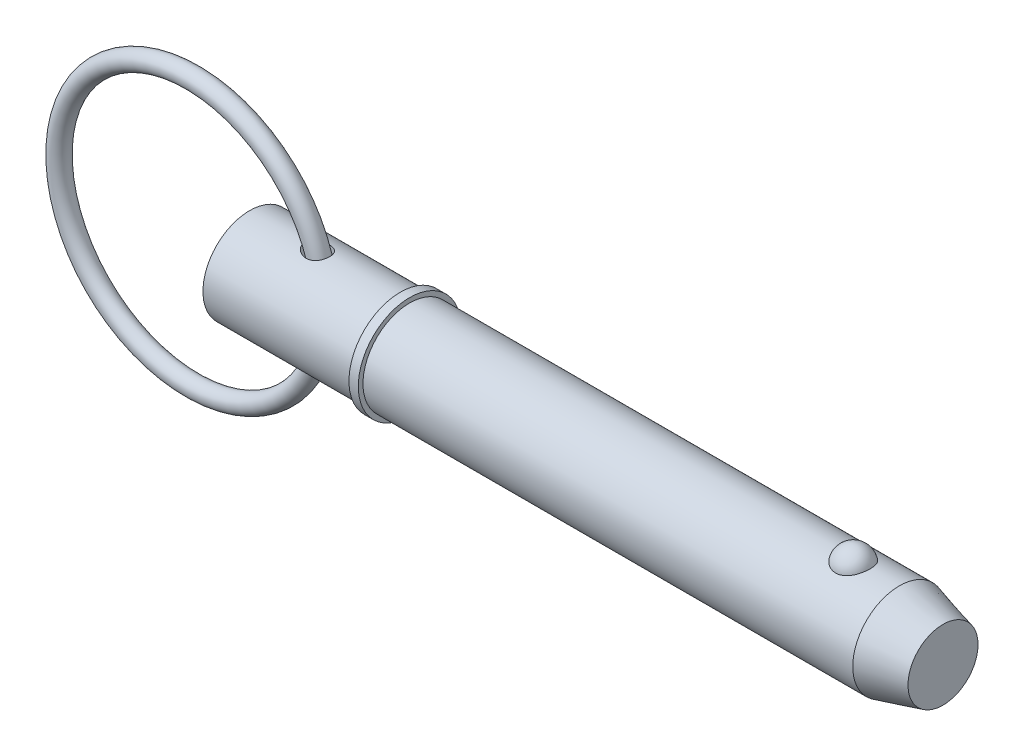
ISO-10303-21;
HEADER;
FILE_DESCRIPTION(('STEP AP214'),'2;1');
FILE_NAME('part.step','',(''),(''),'','','');
FILE_SCHEMA(('AUTOMOTIVE_DESIGN { 1 0 10303 214 1 1 1 1 }'));
ENDSEC;
DATA;
#1=APPLICATION_CONTEXT('core data for automotive mechanical design processes');
#2=APPLICATION_PROTOCOL_DEFINITION('international standard','automotive_design',2000,#1);
#3=PRODUCT_CONTEXT('',#1,'mechanical');
#4=PRODUCT('Part','Part','',(#3));
#5=PRODUCT_RELATED_PRODUCT_CATEGORY('part','',(#4));
#6=PRODUCT_DEFINITION_FORMATION('','',#4);
#7=PRODUCT_DEFINITION_CONTEXT('part definition',#1,'design');
#8=PRODUCT_DEFINITION('design','',#6,#7);
#9=PRODUCT_DEFINITION_SHAPE('','',#8);
#10=(LENGTH_UNIT() NAMED_UNIT(*) SI_UNIT(.MILLI.,.METRE.));
#11=(NAMED_UNIT(*) PLANE_ANGLE_UNIT() SI_UNIT($,.RADIAN.));
#12=(NAMED_UNIT(*) SI_UNIT($,.STERADIAN.) SOLID_ANGLE_UNIT());
#13=UNCERTAINTY_MEASURE_WITH_UNIT(LENGTH_MEASURE(1.E-05),#10,'distance_accuracy_value','');
#14=(GEOMETRIC_REPRESENTATION_CONTEXT(3) GLOBAL_UNCERTAINTY_ASSIGNED_CONTEXT((#13)) GLOBAL_UNIT_ASSIGNED_CONTEXT((#10,
#11,#12)) REPRESENTATION_CONTEXT('',''));
#15=CARTESIAN_POINT('',(0.,0.,0.));
#16=DIRECTION('',(0.,0.,1.));
#17=DIRECTION('',(1.,0.,0.));
#18=AXIS2_PLACEMENT_3D('',#15,#16,#17);
#19=CARTESIAN_POINT('',(-13.640845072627,0.,0.));
#20=DIRECTION('',(0.,0.,1.));
#21=DIRECTION('',(1.,0.,0.));
#22=AXIS2_PLACEMENT_3D('',#19,#20,#21);
#23=TOROIDAL_SURFACE('',#22,31.75,2.223);
#24=CARTESIAN_POINT('',(20.332154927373,0.,0.));
#25=VERTEX_POINT('',#24);
#26=VERTEX_LOOP('',#25);
#27=FACE_BOUND('',#26,.T.);
#28=ADVANCED_FACE('P0_F12',(#27),#23,.T.);
#29=CLOSED_SHELL('',(#28));
#30=MANIFOLD_SOLID_BREP('P0_B1',#29);
#31=CARTESIAN_POINT('',(0.,0.,0.));
#32=DIRECTION('',(1.,0.,0.));
#33=DIRECTION('',(0.,0.,-1.));
#34=AXIS2_PLACEMENT_3D('',#31,#32,#33);
#35=CYLINDRICAL_SURFACE('',#34,11.115);
#36=CARTESIAN_POINT('',(13.5245830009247,11.0328953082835,-1.34849772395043));
#37=CARTESIAN_POINT('',(13.6190616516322,11.0150940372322,-1.49413162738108));
#38=CARTESIAN_POINT('',(13.7272589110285,10.9954577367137,-1.63076546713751));
#39=CARTESIAN_POINT('',(13.9654537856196,10.9550099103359,-1.8834727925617));
#40=CARTESIAN_POINT('',(14.0954990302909,10.9341958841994,-1.99950019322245));
#41=CARTESIAN_POINT('',(14.3718600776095,10.893854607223,-2.20871939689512));
#42=CARTESIAN_POINT('',(14.5180879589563,10.8743212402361,-2.30202655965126));
#43=CARTESIAN_POINT('',(14.8233821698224,10.8385071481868,-2.46515115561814));
#44=CARTESIAN_POINT('',(14.9824448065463,10.8222254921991,-2.53497531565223));
#45=CARTESIAN_POINT('',(15.3233581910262,10.7936101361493,-2.65430007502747));
#46=CARTESIAN_POINT('',(15.5060064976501,10.7817126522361,-2.7016502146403));
#47=CARTESIAN_POINT('',(15.8771124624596,10.7657570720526,-2.76455948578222));
#48=CARTESIAN_POINT('',(16.0655695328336,10.7616981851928,-2.78012182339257));
#49=CARTESIAN_POINT('',(16.4345152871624,10.7624400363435,-2.77724928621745));
#50=CARTESIAN_POINT('',(16.6150121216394,10.7668823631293,-2.76018977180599));
#51=CARTESIAN_POINT('',(16.9695132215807,10.7837407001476,-2.69357457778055));
#52=CARTESIAN_POINT('',(17.1435222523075,10.7961507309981,-2.64404326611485));
#53=CARTESIAN_POINT('',(17.4621418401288,10.8258984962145,-2.51928348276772));
#54=CARTESIAN_POINT('',(17.6079677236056,10.8426430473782,-2.44700611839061));
#55=CARTESIAN_POINT('',(17.884162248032,10.8794194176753,-2.27791740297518));
#56=CARTESIAN_POINT('',(18.0145349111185,10.8994503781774,-2.18111245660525));
#57=CARTESIAN_POINT('',(18.2494965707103,10.9392822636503,-1.9713196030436));
#58=CARTESIAN_POINT('',(18.3550661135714,10.9590421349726,-1.85941863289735));
#59=CARTESIAN_POINT('',(18.5458147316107,10.9970986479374,-1.61919918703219));
#60=CARTESIAN_POINT('',(18.6309947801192,11.0153953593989,-1.49088149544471));
#61=CARTESIAN_POINT('',(18.7786686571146,11.0484675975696,-1.2218388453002));
#62=CARTESIAN_POINT('',(18.8412214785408,11.063252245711,-1.08114735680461));
#63=CARTESIAN_POINT('',(18.9425265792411,11.0877718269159,-0.791025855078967));
#64=CARTESIAN_POINT('',(18.9812780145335,11.0975065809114,-0.641595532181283));
#65=CARTESIAN_POINT('',(19.0343305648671,11.1109435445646,-0.336997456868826));
#66=CARTESIAN_POINT('',(19.0484404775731,11.1145985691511,-0.181794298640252));
#67=CARTESIAN_POINT('',(19.0513147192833,11.1153384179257,0.128864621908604));
#68=CARTESIAN_POINT('',(19.0400783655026,11.112423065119,0.284320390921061));
#69=CARTESIAN_POINT('',(18.9924362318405,11.1003163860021,0.591525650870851));
#70=CARTESIAN_POINT('',(18.9559600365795,11.0911075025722,0.743263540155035));
#71=CARTESIAN_POINT('',(18.858576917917,11.0673920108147,1.0382524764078));
#72=CARTESIAN_POINT('',(18.7976699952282,11.0528854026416,1.18150352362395));
#73=CARTESIAN_POINT('',(18.6529960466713,11.020201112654,1.45511394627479));
#74=CARTESIAN_POINT('',(18.5692772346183,11.0020311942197,1.58549973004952));
#75=CARTESIAN_POINT('',(18.3810003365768,10.9640237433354,1.82995492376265));
#76=CARTESIAN_POINT('',(18.2764441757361,10.9441863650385,1.94402583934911));
#77=CARTESIAN_POINT('',(18.0501398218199,10.9052267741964,2.15183128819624));
#78=CARTESIAN_POINT('',(17.9285270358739,10.8861003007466,2.24571250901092));
#79=CARTESIAN_POINT('',(17.6709592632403,10.8505244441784,2.41175942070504));
#80=CARTESIAN_POINT('',(17.5350055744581,10.8340748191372,2.48392707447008));
#81=CARTESIAN_POINT('',(17.2528390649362,10.8056099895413,2.60497667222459));
#82=CARTESIAN_POINT('',(17.1066353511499,10.7935909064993,2.65387899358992));
#83=CARTESIAN_POINT('',(16.8080326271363,10.7750969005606,2.72799859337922));
#84=CARTESIAN_POINT('',(16.6556326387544,10.7686228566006,2.75321211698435));
#85=CARTESIAN_POINT('',(16.3428877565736,10.761517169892,2.78086153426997));
#86=CARTESIAN_POINT('',(16.1824599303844,10.7611149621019,2.78240297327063));
#87=CARTESIAN_POINT('',(15.863296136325,10.766478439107,2.76156874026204));
#88=CARTESIAN_POINT('',(15.7045607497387,10.7722461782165,2.73918510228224));
#89=CARTESIAN_POINT('',(15.3787211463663,10.7898500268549,2.66904167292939));
#90=CARTESIAN_POINT('',(15.2120794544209,10.8021675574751,2.61925575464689));
#91=CARTESIAN_POINT('',(14.8886284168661,10.8315482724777,2.49496357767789));
#92=CARTESIAN_POINT('',(14.731827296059,10.8486153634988,2.42043695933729));
#93=CARTESIAN_POINT('',(14.4198762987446,10.8870804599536,2.24137362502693));
#94=CARTESIAN_POINT('',(14.2658484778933,10.9087148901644,2.13492229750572));
#95=CARTESIAN_POINT('',(13.9788214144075,10.9526299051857,1.89676517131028));
#96=CARTESIAN_POINT('',(13.8458041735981,10.9749099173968,1.76508120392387));
#97=CARTESIAN_POINT('',(13.6310853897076,11.012885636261,1.50762337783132));
#98=CARTESIAN_POINT('',(13.5444453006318,11.0290026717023,1.38602082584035));
#99=CARTESIAN_POINT('',(13.392158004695,11.0581740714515,1.12983363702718));
#100=CARTESIAN_POINT('',(13.3264946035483,11.0712307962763,0.995259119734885));
#101=CARTESIAN_POINT('',(13.2464179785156,11.0874250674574,0.785640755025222));
#102=CARTESIAN_POINT('',(13.2227369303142,11.0922707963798,0.714166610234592));
#103=CARTESIAN_POINT('',(13.1820656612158,11.1006486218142,0.569277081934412));
#104=CARTESIAN_POINT('',(13.1650721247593,11.1041813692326,0.495862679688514));
#105=CARTESIAN_POINT('',(13.1381118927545,11.1098070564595,0.347711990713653));
#106=CARTESIAN_POINT('',(13.1281436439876,11.1119003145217,0.272975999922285));
#107=CARTESIAN_POINT('',(13.1154243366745,11.1145746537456,0.122890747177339));
#108=CARTESIAN_POINT('',(13.1126723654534,11.1151559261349,0.0475415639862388));
#109=CARTESIAN_POINT('',(13.115160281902,11.1146296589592,-0.160384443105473));
#110=CARTESIAN_POINT('',(13.128061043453,11.111903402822,-0.292944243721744));
#111=CARTESIAN_POINT('',(13.175691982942,11.1019662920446,-0.553751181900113));
#112=CARTESIAN_POINT('',(13.2104121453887,11.094757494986,-0.682000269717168));
#113=CARTESIAN_POINT('',(13.2891255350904,11.0787645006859,-0.901873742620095));
#114=CARTESIAN_POINT('',(13.3290466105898,11.0707438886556,-0.995044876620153));
#115=CARTESIAN_POINT('',(13.4192915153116,11.0529876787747,-1.17599209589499));
#116=CARTESIAN_POINT('',(13.4696154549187,11.0432520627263,-1.26376812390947));
#117=CARTESIAN_POINT('',(13.5245830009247,11.0328953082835,-1.34849772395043));
#118=B_SPLINE_CURVE_WITH_KNOTS('',3,(#36,#37,#38,#39,#40,#41,#42,#43,#44,#45,#46,#47,#48,#49,
#50,#51,#52,#53,#54,#55,#56,#57,#58,#59,#60,#61,#62,#63,#64,#65,#66,#67,#68,#69,#70,#71,#72,#73,
#74,#75,#76,#77,#78,#79,#80,#81,#82,#83,#84,#85,#86,#87,#88,#89,#90,#91,#92,#93,#94,#95,#96,#97,
#98,#99,#100,#101,#102,#103,#104,#105,#106,#107,#108,#109,#110,#111,#112,#113,#114,#115,#116,
#117),.UNSPECIFIED.,.T.,.F.,(4,2,2,2,2,2,2,2,2,2,2,2,2,2,2,2,2,2,2,2,2,2,2,2,2,2,2,2,2,2,2,2,2,
2,2,2,2,2,2,2,4),(0.,0.52309976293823,1.04735506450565,1.56889024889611,2.09027590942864,
2.65465173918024,3.21897064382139,3.76002078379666,4.30066536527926,4.78898318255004,
5.27717362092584,5.74028268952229,6.20336964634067,6.665240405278,7.12712754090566,
7.59258295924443,8.05805091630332,8.52482272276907,8.99159451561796,9.45738731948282,
9.9231371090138,10.3853792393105,10.8475795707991,11.3093743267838,11.7712422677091,
12.2505208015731,12.7299589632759,13.2508366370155,13.7721440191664,14.334890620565,
14.8971525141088,15.3459336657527,15.7943675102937,16.0204422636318,16.2464047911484,
16.4723173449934,16.6982013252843,17.095711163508,17.4930386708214,17.7973741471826,
18.1017128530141),.UNSPECIFIED.);
#119=CARTESIAN_POINT('',(13.5245830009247,11.0328953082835,-1.34849772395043));
#120=VERTEX_POINT('',#119);
#121=EDGE_CURVE('P1_E42',#120,#120,#118,.T.);
#122=ORIENTED_EDGE('',*,*,#121,.T.);
#123=EDGE_LOOP('',(#122));
#124=FACE_BOUND('',#123,.T.);
#125=CARTESIAN_POINT('',(0.,0.,0.));
#126=DIRECTION('',(1.,0.,0.));
#127=DIRECTION('',(0.,0.,-1.));
#128=AXIS2_PLACEMENT_3D('',#125,#126,#127);
#129=CIRCLE('',#128,11.115);
#130=CARTESIAN_POINT('',(0.,0.,-11.115));
#131=VERTEX_POINT('',#130);
#132=EDGE_CURVE('P1_E9',#131,#131,#129,.T.);
#133=ORIENTED_EDGE('',*,*,#132,.T.);
#134=EDGE_LOOP('',(#133));
#135=FACE_BOUND('',#134,.T.);
#136=CARTESIAN_POINT('',(35.877,0.,0.));
#137=DIRECTION('',(1.,0.,0.));
#138=DIRECTION('',(0.,0.,-1.));
#139=AXIS2_PLACEMENT_3D('',#136,#137,#138);
#140=CIRCLE('',#139,11.115);
#141=CARTESIAN_POINT('',(35.877,0.,-11.115));
#142=VERTEX_POINT('',#141);
#143=EDGE_CURVE('P1_E25',#142,#142,#140,.T.);
#144=ORIENTED_EDGE('',*,*,#143,.F.);
#145=EDGE_LOOP('',(#144));
#146=FACE_BOUND('',#145,.T.);
#147=CARTESIAN_POINT('',(13.5245830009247,-11.0328953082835,-1.34849772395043));
#148=CARTESIAN_POINT('',(13.449887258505,-11.0469690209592,-1.233356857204));
#149=CARTESIAN_POINT('',(13.3837464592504,-11.0598986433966,-1.11255897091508));
#150=CARTESIAN_POINT('',(13.271526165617,-11.0822620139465,-0.861680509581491));
#151=CARTESIAN_POINT('',(13.2254273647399,-11.0916991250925,-0.731609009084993));
#152=CARTESIAN_POINT('',(13.1557497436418,-11.1060943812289,-0.464578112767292));
#153=CARTESIAN_POINT('',(13.1322820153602,-11.111030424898,-0.327588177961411));
#154=CARTESIAN_POINT('',(13.1098958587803,-11.1157368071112,-0.0515139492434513));
#155=CARTESIAN_POINT('',(13.1109730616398,-11.1155080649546,0.0875699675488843));
#156=CARTESIAN_POINT('',(13.1367722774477,-11.110088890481,0.354927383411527));
#157=CARTESIAN_POINT('',(13.160070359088,-11.1051972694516,0.483348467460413));
#158=CARTESIAN_POINT('',(13.2268311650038,-11.091413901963,0.734581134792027));
#159=CARTESIAN_POINT('',(13.2702981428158,-11.0825213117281,0.857391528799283));
#160=CARTESIAN_POINT('',(13.3769008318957,-11.0612491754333,1.09871322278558));
#161=CARTESIAN_POINT('',(13.4406446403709,-11.048763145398,1.21694419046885));
#162=CARTESIAN_POINT('',(13.5844860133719,-11.0215642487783,1.44267020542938));
#163=CARTESIAN_POINT('',(13.6645903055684,-11.0068504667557,1.55016080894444));
#164=CARTESIAN_POINT('',(13.8511803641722,-10.9741237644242,1.76795565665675));
#165=CARTESIAN_POINT('',(13.959808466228,-10.9559422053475,1.87639683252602));
#166=CARTESIAN_POINT('',(14.1916437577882,-10.9197998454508,2.07642617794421));
#167=CARTESIAN_POINT('',(14.3148607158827,-10.901839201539,2.16800294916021));
#168=CARTESIAN_POINT('',(14.5931107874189,-10.8649902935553,2.34622033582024));
#169=CARTESIAN_POINT('',(14.7501095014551,-10.8463937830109,2.42986679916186));
#170=CARTESIAN_POINT('',(15.0757118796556,-10.8136392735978,2.57171975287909));
#171=CARTESIAN_POINT('',(15.2443214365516,-10.7994835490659,2.62991321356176));
#172=CARTESIAN_POINT('',(15.599068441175,-10.7767894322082,2.72147498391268));
#173=CARTESIAN_POINT('',(15.7856559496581,-10.768622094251,2.75321798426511));
#174=CARTESIAN_POINT('',(16.1617095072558,-10.7608206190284,2.78356776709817));
#175=CARTESIAN_POINT('',(16.3511739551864,-10.7611818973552,2.78219235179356));
#176=CARTESIAN_POINT('',(16.7138126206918,-10.7705428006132,2.7457129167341));
#177=CARTESIAN_POINT('',(16.8872269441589,-10.7789612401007,2.71287798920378));
#178=CARTESIAN_POINT('',(17.2247245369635,-10.8028011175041,2.61632772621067));
#179=CARTESIAN_POINT('',(17.3888134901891,-10.8182182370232,2.55263143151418));
#180=CARTESIAN_POINT('',(17.6871641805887,-10.8524191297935,2.40281428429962));
#181=CARTESIAN_POINT('',(17.8227812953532,-10.8707652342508,2.31928155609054));
#182=CARTESIAN_POINT('',(18.0770765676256,-10.9094513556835,2.12988301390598));
#183=CARTESIAN_POINT('',(18.1957578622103,-10.9297910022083,2.0240213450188));
#184=CARTESIAN_POINT('',(18.4088055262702,-10.9693230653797,1.79719870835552));
#185=CARTESIAN_POINT('',(18.5038890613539,-10.9885305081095,1.67691225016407));
#186=CARTESIAN_POINT('',(18.6726701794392,-11.0244347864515,1.42183894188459));
#187=CARTESIAN_POINT('',(18.7463681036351,-11.0411316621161,1.28705232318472));
#188=CARTESIAN_POINT('',(18.8708297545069,-11.0702507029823,1.00634471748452));
#189=CARTESIAN_POINT('',(18.9215212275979,-11.0826593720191,0.860390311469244));
#190=CARTESIAN_POINT('',(18.9984973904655,-11.1017993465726,0.561823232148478));
#191=CARTESIAN_POINT('',(19.0247811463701,-11.1085304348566,0.409210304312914));
#192=CARTESIAN_POINT('',(19.0524622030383,-11.1156244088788,0.100537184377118));
#193=CARTESIAN_POINT('',(19.0536873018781,-11.1159432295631,-0.0555394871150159));
#194=CARTESIAN_POINT('',(19.0307837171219,-11.110065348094,-0.365700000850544));
#195=CARTESIAN_POINT('',(19.0066544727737,-11.1038685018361,-0.519783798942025));
#196=CARTESIAN_POINT('',(18.9335163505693,-11.0856111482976,-0.821817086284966));
#197=CARTESIAN_POINT('',(18.88447016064,-11.0735418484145,-0.969757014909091));
#198=CARTESIAN_POINT('',(18.7625929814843,-11.0448501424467,-1.25502066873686));
#199=CARTESIAN_POINT('',(18.6897623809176,-11.0282278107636,-1.39234456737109));
#200=CARTESIAN_POINT('',(18.522359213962,-10.9923333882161,-1.65195905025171));
#201=CARTESIAN_POINT('',(18.427863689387,-10.9730707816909,-1.77430060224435));
#202=CARTESIAN_POINT('',(18.2194216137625,-10.9340072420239,-2.00099176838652));
#203=CARTESIAN_POINT('',(18.1054772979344,-10.9142063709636,-2.10534344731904));
#204=CARTESIAN_POINT('',(17.8622613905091,-10.8764452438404,-2.2924289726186));
#205=CARTESIAN_POINT('',(17.7331196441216,-10.8584715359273,-2.3753290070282));
#206=CARTESIAN_POINT('',(17.4625069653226,-10.8261386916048,-2.51860389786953));
#207=CARTESIAN_POINT('',(17.3210365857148,-10.8117793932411,-2.57897976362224));
#208=CARTESIAN_POINT('',(17.0290309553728,-10.7880576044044,-2.67648805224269));
#209=CARTESIAN_POINT('',(16.8784484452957,-10.7787241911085,-2.71348542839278));
#210=CARTESIAN_POINT('',(16.573148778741,-10.7659618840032,-2.7636855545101));
#211=CARTESIAN_POINT('',(16.4184306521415,-10.7625343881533,-2.77688267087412));
#212=CARTESIAN_POINT('',(16.1008073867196,-10.761643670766,-2.78033419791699));
#213=CARTESIAN_POINT('',(15.9378898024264,-10.7644957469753,-2.76937572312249));
#214=CARTESIAN_POINT('',(15.6157286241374,-10.7762062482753,-2.72344300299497));
#215=CARTESIAN_POINT('',(15.4564861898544,-10.7850665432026,-2.68846128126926));
#216=CARTESIAN_POINT('',(15.1305734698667,-10.808737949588,-2.59174021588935));
#217=CARTESIAN_POINT('',(14.9645834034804,-10.8240246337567,-2.52782071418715));
#218=CARTESIAN_POINT('',(14.6448218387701,-10.8585969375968,-2.37491543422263));
#219=CARTESIAN_POINT('',(14.4910653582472,-10.8778873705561,-2.28589943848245));
#220=CARTESIAN_POINT('',(14.1837929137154,-10.920550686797,-2.07312951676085));
#221=CARTESIAN_POINT('',(14.0321999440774,-10.9441390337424,-1.94661563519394));
#222=CARTESIAN_POINT('',(13.756115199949,-10.9902311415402,-1.66673537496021));
#223=CARTESIAN_POINT('',(13.6315733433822,-11.0127368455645,-1.51341958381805));
#224=CARTESIAN_POINT('',(13.5245830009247,-11.0328953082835,-1.34849772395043));
#225=B_SPLINE_CURVE_WITH_KNOTS('',3,(#147,#148,#149,#150,#151,#152,#153,#154,#155,#156,#157,
#158,#159,#160,#161,#162,#163,#164,#165,#166,#167,#168,#169,#170,#171,#172,#173,#174,#175,#176,
#177,#178,#179,#180,#181,#182,#183,#184,#185,#186,#187,#188,#189,#190,#191,#192,#193,#194,#195,
#196,#197,#198,#199,#200,#201,#202,#203,#204,#205,#206,#207,#208,#209,#210,#211,#212,#213,#214,
#215,#216,#217,#218,#219,#220,#221,#222,#223,#224),.UNSPECIFIED.,.T.,.F.,(4,2,2,2,2,2,2,2,2,2,2,
2,2,2,2,2,2,2,2,2,2,2,2,2,2,2,2,2,2,2,2,2,2,2,2,2,2,2,4),(0.,0.4133945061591,0.8263899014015,
1.24140245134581,1.65634113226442,2.04635967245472,2.43646050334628,2.83958259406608,
3.24287078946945,3.70479277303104,4.16702582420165,4.70130512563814,5.23585761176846,
5.80123945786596,6.36631739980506,6.89348344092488,7.42032464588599,7.8989135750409,
8.37741373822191,8.83881993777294,9.30021877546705,9.76305681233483,10.2259125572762,
10.6919479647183,11.1579936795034,11.6247393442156,12.0914773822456,12.55658073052,
13.0216306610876,13.4829619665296,13.9442725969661,14.408224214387,14.8722856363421,
15.3601762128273,15.8482186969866,16.3815107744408,16.9154477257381,17.5086806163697,
18.1008056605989),.UNSPECIFIED.);
#226=CARTESIAN_POINT('',(13.5245830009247,-11.0328953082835,-1.34849772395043));
#227=VERTEX_POINT('',#226);
#228=EDGE_CURVE('P1_E17',#227,#227,#225,.T.);
#229=ORIENTED_EDGE('',*,*,#228,.T.);
#230=EDGE_LOOP('',(#229));
#231=FACE_BOUND('',#230,.T.);
#232=ADVANCED_FACE('P1_F13',(#124,#135,#146,#231),#35,.T.);
#233=CARTESIAN_POINT('',(0.,0.,0.));
#234=DIRECTION('',(1.,0.,0.));
#235=DIRECTION('',(0.,0.,-1.));
#236=AXIS2_PLACEMENT_3D('',#233,#234,#235);
#237=CYLINDRICAL_SURFACE('',#236,11.115);
#238=CARTESIAN_POINT('',(154.729563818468,0.,0.));
#239=DIRECTION('',(1.,0.,0.));
#240=DIRECTION('',(0.,0.,-1.));
#241=AXIS2_PLACEMENT_3D('',#238,#239,#240);
#242=CIRCLE('',#241,11.115);
#243=CARTESIAN_POINT('',(154.729563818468,0.,-11.115));
#244=VERTEX_POINT('',#243);
#245=EDGE_CURVE('P1_E99',#244,#244,#242,.T.);
#246=ORIENTED_EDGE('',*,*,#245,.F.);
#247=EDGE_LOOP('',(#246));
#248=FACE_BOUND('',#247,.T.);
#249=CARTESIAN_POINT('',(38.1,0.,0.));
#250=DIRECTION('',(1.,0.,0.));
#251=DIRECTION('',(0.,0.,-1.));
#252=AXIS2_PLACEMENT_3D('',#249,#250,#251);
#253=CIRCLE('',#252,11.115);
#254=CARTESIAN_POINT('',(38.1,0.,-11.115));
#255=VERTEX_POINT('',#254);
#256=EDGE_CURVE('P1_E96',#255,#255,#253,.T.);
#257=ORIENTED_EDGE('',*,*,#256,.T.);
#258=EDGE_LOOP('',(#257));
#259=FACE_BOUND('',#258,.T.);
#260=CARTESIAN_POINT('',(143.731068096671,10.3028087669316,4.17077409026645));
#261=CARTESIAN_POINT('',(143.514775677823,10.3028003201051,4.17078240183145));
#262=CARTESIAN_POINT('',(143.298548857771,10.3098895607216,4.15340593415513));
#263=CARTESIAN_POINT('',(142.872540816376,10.3373834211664,4.08449540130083));
#264=CARTESIAN_POINT('',(142.662757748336,10.3577841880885,4.0329712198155));
#265=CARTESIAN_POINT('',(142.255782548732,10.4095237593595,3.89746513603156));
#266=CARTESIAN_POINT('',(142.058572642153,10.4408466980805,3.81353029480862));
#267=CARTESIAN_POINT('',(141.681338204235,10.5110236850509,3.61560339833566));
#268=CARTESIAN_POINT('',(141.501317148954,10.5498792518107,3.50160528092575));
#269=CARTESIAN_POINT('',(141.157684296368,10.6322884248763,3.24292464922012));
#270=CARTESIAN_POINT('',(140.994686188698,10.6759443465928,3.09746040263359));
#271=CARTESIAN_POINT('',(140.694591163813,10.7625291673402,2.7817192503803));
#272=CARTESIAN_POINT('',(140.557499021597,10.8054579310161,2.61143778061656));
#273=CARTESIAN_POINT('',(140.306408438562,10.8881935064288,2.24226695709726));
#274=CARTESIAN_POINT('',(140.193710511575,10.9277761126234,2.04244123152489));
#275=CARTESIAN_POINT('',(140.001777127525,10.997484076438,1.62578254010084));
#276=CARTESIAN_POINT('',(139.922544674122,11.0276085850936,1.40894804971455));
#277=CARTESIAN_POINT('',(139.798303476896,11.0756732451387,0.961250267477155));
#278=CARTESIAN_POINT('',(139.753760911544,11.0934470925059,0.730239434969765));
#279=CARTESIAN_POINT('',(139.701569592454,11.1143331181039,0.263439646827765));
#280=CARTESIAN_POINT('',(139.693920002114,11.1174456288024,0.0276507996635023));
#281=CARTESIAN_POINT('',(139.71561056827,11.1087161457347,-0.440729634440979));
#282=CARTESIAN_POINT('',(139.744762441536,11.0969502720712,-0.673331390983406));
#283=CARTESIAN_POINT('',(139.839143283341,11.0597872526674,-1.12996621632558));
#284=CARTESIAN_POINT('',(139.904372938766,11.0343898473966,-1.35399912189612));
#285=CARTESIAN_POINT('',(140.06969844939,10.972515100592,-1.78750286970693));
#286=CARTESIAN_POINT('',(140.16983863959,10.9360236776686,-1.9969547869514));
#287=CARTESIAN_POINT('',(140.402940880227,10.8557595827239,-2.3952066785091));
#288=CARTESIAN_POINT('',(140.535905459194,10.8119863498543,-2.5840050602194));
#289=CARTESIAN_POINT('',(140.832407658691,10.7216733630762,-2.93635726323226));
#290=CARTESIAN_POINT('',(140.996056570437,10.675123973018,-3.09981510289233));
#291=CARTESIAN_POINT('',(141.349860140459,10.5846571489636,-3.39592247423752));
#292=CARTESIAN_POINT('',(141.540012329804,10.5407394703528,-3.52857487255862));
#293=CARTESIAN_POINT('',(141.93750141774,10.4616690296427,-3.75646057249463));
#294=CARTESIAN_POINT('',(142.14436705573,10.4263443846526,-3.85245432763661));
#295=CARTESIAN_POINT('',(142.572954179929,10.3675574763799,-4.00798747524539));
#296=CARTESIAN_POINT('',(142.794670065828,10.344090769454,-4.0675405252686));
#297=CARTESIAN_POINT('',(143.234669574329,10.3128282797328,-4.14614314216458));
#298=CARTESIAN_POINT('',(143.452565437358,10.3043040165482,-4.1670783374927));
#299=CARTESIAN_POINT('',(143.88894951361,10.3016771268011,-4.17357158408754));
#300=CARTESIAN_POINT('',(144.107437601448,10.3075716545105,-4.15913661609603));
#301=CARTESIAN_POINT('',(144.531744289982,10.3326686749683,-4.09636961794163));
#302=CARTESIAN_POINT('',(144.737745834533,10.3514555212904,-4.0490957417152));
#303=CARTESIAN_POINT('',(145.138576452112,10.399818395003,-3.92320197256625));
#304=CARTESIAN_POINT('',(145.3334046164,10.4293952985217,-3.84457953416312));
#305=CARTESIAN_POINT('',(145.711191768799,10.4969600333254,-3.65612410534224));
#306=CARTESIAN_POINT('',(145.893797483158,10.5351178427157,-3.54564545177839));
#307=CARTESIAN_POINT('',(146.238204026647,10.6154999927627,-3.29718036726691));
#308=CARTESIAN_POINT('',(146.400000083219,10.657725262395,-3.15918764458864));
#309=CARTESIAN_POINT('',(146.706959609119,10.744212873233,-2.85163580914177));
#310=CARTESIAN_POINT('',(146.850891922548,10.7884718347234,-2.68084605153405));
#311=CARTESIAN_POINT('',(147.109237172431,10.872374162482,-2.31721864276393));
#312=CARTESIAN_POINT('',(147.223644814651,10.9120167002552,-2.12437704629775));
#313=CARTESIAN_POINT('',(147.423873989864,10.9838919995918,-1.71516999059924));
#314=CARTESIAN_POINT('',(147.50866178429,11.0158465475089,-1.49824866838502));
#315=CARTESIAN_POINT('',(147.64268382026,11.0673523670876,-1.05228572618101));
#316=CARTESIAN_POINT('',(147.691917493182,11.086903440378,-0.823243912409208));
#317=CARTESIAN_POINT('',(147.753891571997,11.1116323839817,-0.359087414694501));
#318=CARTESIAN_POINT('',(147.766566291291,11.1167843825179,-0.123962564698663));
#319=CARTESIAN_POINT('',(147.754973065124,11.1121144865,0.345220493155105));
#320=CARTESIAN_POINT('',(147.730705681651,11.1022928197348,0.57927871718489));
#321=CARTESIAN_POINT('',(147.645907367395,11.0687504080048,1.03866534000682));
#322=CARTESIAN_POINT('',(147.585529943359,11.0450885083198,1.26402641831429));
#323=CARTESIAN_POINT('',(147.429853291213,10.9863185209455,1.70076772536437));
#324=CARTESIAN_POINT('',(147.334551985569,10.9512097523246,1.91214712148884));
#325=CARTESIAN_POINT('',(147.110397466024,10.8729733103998,2.316083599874));
#326=CARTESIAN_POINT('',(146.981380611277,10.8298068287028,2.50854240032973));
#327=CARTESIAN_POINT('',(146.692732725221,10.7401896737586,2.86808766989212));
#328=CARTESIAN_POINT('',(146.533102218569,10.6937390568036,3.03517457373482));
#329=CARTESIAN_POINT('',(146.187534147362,10.6029321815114,3.33857581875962));
#330=CARTESIAN_POINT('',(146.001708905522,10.5585680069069,3.47501541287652));
#331=CARTESIAN_POINT('',(145.607875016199,10.4769321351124,3.71390897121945));
#332=CARTESIAN_POINT('',(145.399863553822,10.439661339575,3.81635861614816));
#333=CARTESIAN_POINT('',(144.954066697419,10.3749407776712,3.98910631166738));
#334=CARTESIAN_POINT('',(144.715234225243,10.3482457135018,4.05700929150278));
#335=CARTESIAN_POINT('',(144.227925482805,10.312188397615,4.14782844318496));
#336=CARTESIAN_POINT('',(143.979453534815,10.3028184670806,4.17076454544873));
#337=CARTESIAN_POINT('',(143.731068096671,10.3028087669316,4.17077409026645));
#338=B_SPLINE_CURVE_WITH_KNOTS('',3,(#260,#261,#262,#263,#264,#265,#266,#267,#268,#269,#270,
#271,#272,#273,#274,#275,#276,#277,#278,#279,#280,#281,#282,#283,#284,#285,#286,#287,#288,#289,
#290,#291,#292,#293,#294,#295,#296,#297,#298,#299,#300,#301,#302,#303,#304,#305,#306,#307,#308,
#309,#310,#311,#312,#313,#314,#315,#316,#317,#318,#319,#320,#321,#322,#323,#324,#325,#326,#327,
#328,#329,#330,#331,#332,#333,#334,#335,#336,#337),.UNSPECIFIED.,.T.,.F.,(4,2,2,2,2,2,2,2,2,2,2,
2,2,2,2,2,2,2,2,2,2,2,2,2,2,2,2,2,2,2,2,2,2,2,2,2,2,2,4),(0.,0.64796614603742,1.29574482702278,
1.9425864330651,2.58955857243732,3.25496465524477,3.92049326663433,4.61566368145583,
5.31089647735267,6.01531821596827,6.71972398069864,7.42054043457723,8.12137023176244,
8.82309331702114,9.52487047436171,10.2292439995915,10.9335519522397,11.6223330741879,
12.3108558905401,12.9647664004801,13.6185478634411,14.252184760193,14.8858731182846,
15.5334360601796,16.1811472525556,16.8611459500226,17.5412664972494,18.2431855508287,
18.9451158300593,19.6483065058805,20.3514864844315,21.0516982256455,21.7519516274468,
22.4556690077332,23.1593743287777,23.8601491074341,24.5610129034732,25.3054529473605,
26.049562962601),.UNSPECIFIED.);
#339=CARTESIAN_POINT('',(143.731068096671,10.3028087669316,4.17077409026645));
#340=VERTEX_POINT('',#339);
#341=EDGE_CURVE('P1_E34',#340,#340,#338,.T.);
#342=ORIENTED_EDGE('',*,*,#341,.T.);
#343=EDGE_LOOP('',(#342));
#344=FACE_BOUND('',#343,.T.);
#345=ADVANCED_FACE('P1_F46',(#248,#259,#344),#237,.T.);
#346=CARTESIAN_POINT('',(0.,0.,0.));
#347=DIRECTION('',(-1.,0.,0.));
#348=DIRECTION('',(0.,0.,1.));
#349=AXIS2_PLACEMENT_3D('',#346,#347,#348);
#350=PLANE('',#349);
#351=ORIENTED_EDGE('',*,*,#132,.F.);
#352=EDGE_LOOP('',(#351));
#353=FACE_BOUND('',#352,.T.);
#354=ADVANCED_FACE('P1_F15',(#353),#350,.T.);
#355=CARTESIAN_POINT('',(35.877,11.115,0.));
#356=DIRECTION('',(-1.,0.,0.));
#357=DIRECTION('',(0.,0.,1.));
#358=AXIS2_PLACEMENT_3D('',#355,#356,#357);
#359=PLANE('',#358);
#360=ORIENTED_EDGE('',*,*,#143,.T.);
#361=EDGE_LOOP('',(#360));
#362=FACE_BOUND('',#361,.T.);
#363=CARTESIAN_POINT('',(35.877,0.,0.));
#364=DIRECTION('',(1.,0.,0.));
#365=DIRECTION('',(0.,0.,-1.));
#366=AXIS2_PLACEMENT_3D('',#363,#364,#365);
#367=CIRCLE('',#366,12.2265);
#368=CARTESIAN_POINT('',(35.877,0.,-12.2265));
#369=VERTEX_POINT('',#368);
#370=EDGE_CURVE('P1_E30',#369,#369,#367,.T.);
#371=ORIENTED_EDGE('',*,*,#370,.F.);
#372=EDGE_LOOP('',(#371));
#373=FACE_BOUND('',#372,.T.);
#374=ADVANCED_FACE('P1_F81',(#362,#373),#359,.T.);
#375=CARTESIAN_POINT('',(0.,0.,0.));
#376=DIRECTION('',(1.,0.,0.));
#377=DIRECTION('',(0.,0.,-1.));
#378=AXIS2_PLACEMENT_3D('',#375,#376,#377);
#379=CYLINDRICAL_SURFACE('',#378,12.2265);
#380=ORIENTED_EDGE('',*,*,#370,.T.);
#381=EDGE_LOOP('',(#380));
#382=FACE_BOUND('',#381,.T.);
#383=CARTESIAN_POINT('',(38.1,0.,0.));
#384=DIRECTION('',(1.,0.,0.));
#385=DIRECTION('',(0.,0.,-1.));
#386=AXIS2_PLACEMENT_3D('',#383,#384,#385);
#387=CIRCLE('',#386,12.2265);
#388=CARTESIAN_POINT('',(38.1,0.,-12.2265));
#389=VERTEX_POINT('',#388);
#390=EDGE_CURVE('P1_E95',#389,#389,#387,.T.);
#391=ORIENTED_EDGE('',*,*,#390,.F.);
#392=EDGE_LOOP('',(#391));
#393=FACE_BOUND('',#392,.T.);
#394=ADVANCED_FACE('P1_F68',(#382,#393),#379,.T.);
#395=CARTESIAN_POINT('',(38.1,12.2265,0.));
#396=DIRECTION('',(1.,0.,0.));
#397=DIRECTION('',(0.,0.,-1.));
#398=AXIS2_PLACEMENT_3D('',#395,#396,#397);
#399=PLANE('',#398);
#400=ORIENTED_EDGE('',*,*,#390,.T.);
#401=EDGE_LOOP('',(#400));
#402=FACE_BOUND('',#401,.T.);
#403=ORIENTED_EDGE('',*,*,#256,.F.);
#404=EDGE_LOOP('',(#403));
#405=FACE_BOUND('',#404,.T.);
#406=ADVANCED_FACE('P1_F62',(#402,#405),#399,.T.);
#407=CARTESIAN_POINT('',(165.1,0.,0.));
#408=DIRECTION('',(-1.,0.,0.));
#409=DIRECTION('',(0.,0.,1.));
#410=AXIS2_PLACEMENT_3D('',#407,#408,#409);
#411=CONICAL_SURFACE('',#410,8.33625000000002,0.26179938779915);
#412=ORIENTED_EDGE('',*,*,#245,.T.);
#413=EDGE_LOOP('',(#412));
#414=FACE_BOUND('',#413,.T.);
#415=CARTESIAN_POINT('',(165.1,0.,0.));
#416=DIRECTION('',(1.,0.,0.));
#417=DIRECTION('',(0.,0.,-1.));
#418=AXIS2_PLACEMENT_3D('',#415,#416,#417);
#419=CIRCLE('',#418,8.33625000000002);
#420=CARTESIAN_POINT('',(165.1,0.,-8.33625000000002));
#421=VERTEX_POINT('',#420);
#422=EDGE_CURVE('P1_E41',#421,#421,#419,.T.);
#423=ORIENTED_EDGE('',*,*,#422,.F.);
#424=EDGE_LOOP('',(#423));
#425=FACE_BOUND('',#424,.T.);
#426=ADVANCED_FACE('P1_F59',(#414,#425),#411,.T.);
#427=CARTESIAN_POINT('',(165.1,8.33625000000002,0.));
#428=DIRECTION('',(1.,0.,0.));
#429=DIRECTION('',(0.,0.,-1.));
#430=AXIS2_PLACEMENT_3D('',#427,#428,#429);
#431=PLANE('',#430);
#432=ORIENTED_EDGE('',*,*,#422,.T.);
#433=EDGE_LOOP('',(#432));
#434=FACE_BOUND('',#433,.T.);
#435=ADVANCED_FACE('P1_F55',(#434),#431,.T.);
#436=CARTESIAN_POINT('',(143.731068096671,10.0035,0.));
#437=DIRECTION('',(-1.,0.,0.));
#438=DIRECTION('',(0.,1.,0.));
#439=AXIS2_PLACEMENT_3D('',#436,#437,#438);
#440=SPHERICAL_SURFACE('',#439,4.18150000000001);
#441=ORIENTED_EDGE('',*,*,#341,.F.);
#442=EDGE_LOOP('',(#441));
#443=FACE_BOUND('',#442,.T.);
#444=ADVANCED_FACE('P1_F50',(#443),#440,.T.);
#445=CARTESIAN_POINT('',(-13.640845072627,0.,0.));
#446=DIRECTION('',(0.,0.,1.));
#447=DIRECTION('',(1.,0.,0.));
#448=AXIS2_PLACEMENT_3D('',#445,#446,#447);
#449=TOROIDAL_SURFACE('',#448,31.75,2.77875);
#450=ORIENTED_EDGE('',*,*,#228,.F.);
#451=EDGE_LOOP('',(#450));
#452=FACE_BOUND('',#451,.T.);
#453=ORIENTED_EDGE('',*,*,#121,.F.);
#454=EDGE_LOOP('',(#453));
#455=FACE_BOUND('',#454,.T.);
#456=ADVANCED_FACE('P1_F54',(#452,#455),#449,.F.);
#457=CLOSED_SHELL('',(#232,#345,#354,#374,#394,#406,#426,#435,#444,#456));
#458=MANIFOLD_SOLID_BREP('P1_B1',#457);
#459=ADVANCED_BREP_SHAPE_REPRESENTATION('',(#18,#30,#458),#14);
#460=SHAPE_DEFINITION_REPRESENTATION(#9,#459);
ENDSEC;
END-ISO-10303-21;
